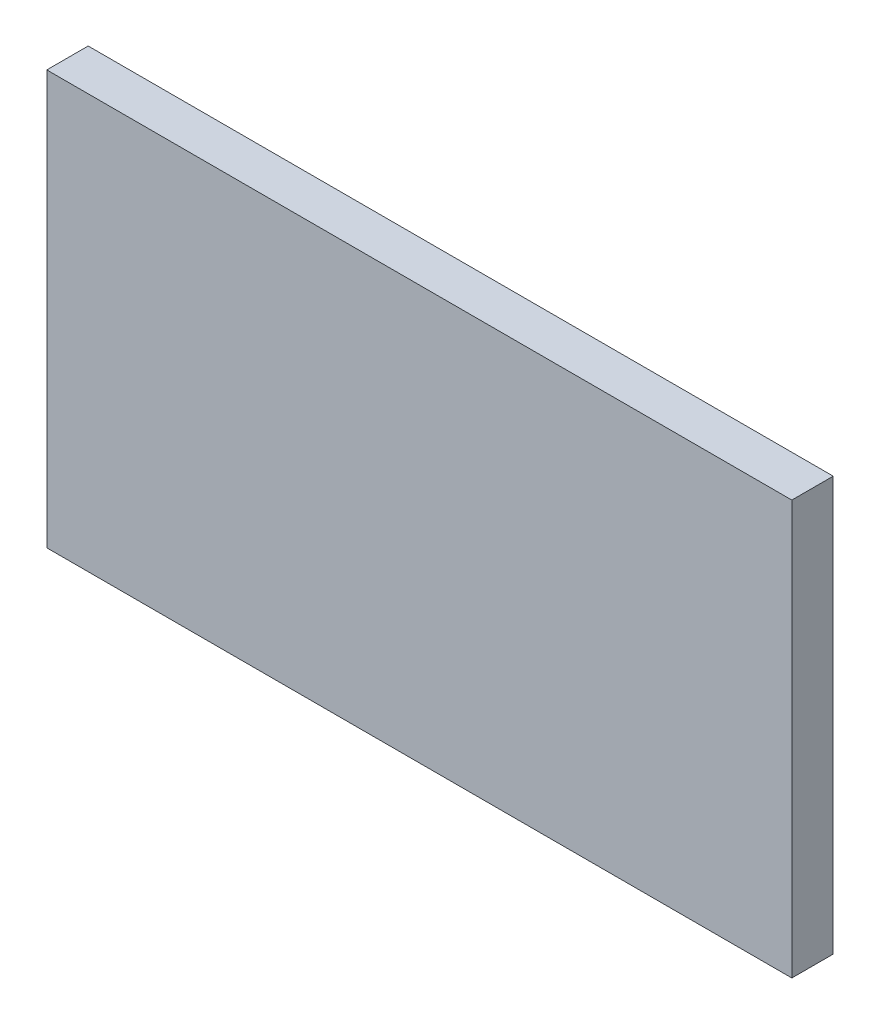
from build123d import *

# Parameters (mm, degrees)
SKETCH2_W      = 11.43
SKETCH2_H      = 6.35
EXTRUDE2_DEPTH = 0.635


with BuildPart() as part:
    # Sketch2 → Extrude2 (new body)
    with BuildSketch(Plane.XY):
        with Locations((5.715, 3.175)):
            Rectangle(SKETCH2_W, SKETCH2_H)
    extrude(amount=EXTRUDE2_DEPTH)


solid = part.part
